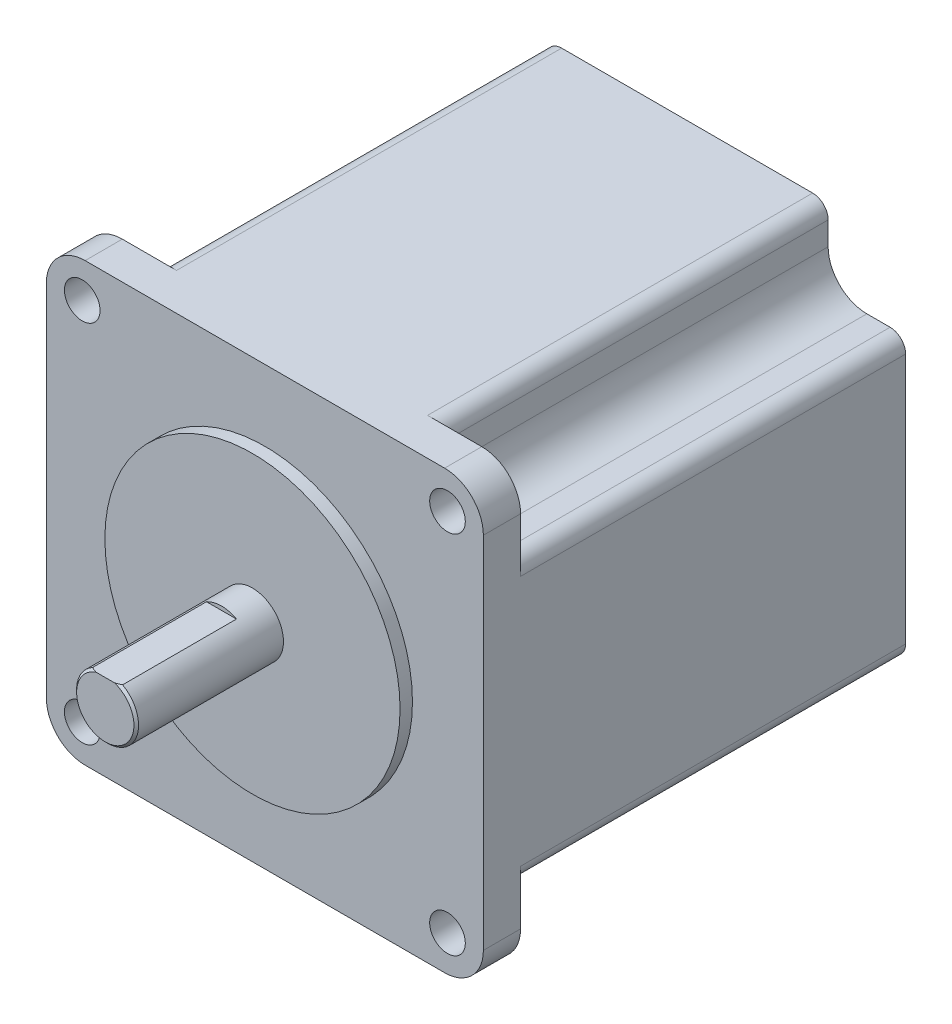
from build123d import *

# Parameters (mm, degrees)
SKETCH_1_R          = 19.05
EXTRUDE_1_DEPTH     = 1.6
SKETCH_2_R          = 4
EXTRUDE_2_DEPTH     = 19
CUT_EXTRUDE_START   = -15
CUT_EXTRUDE_1_DEPTH = 15
EXTRUDE_3_DEPTH     = 54.5
CUT_EXTRUDE_START_2 = -49.7
CUT_EXTRUDE_2_DEPTH = 49.7
SKETCH_6_R          = 2.3
CUT_EXTRUDE_3_DEPTH = 49.7
CHAMFER_1_SIZE      = 0.3


with BuildPart() as part:
    # Sketch 1 → Extrude 1 (new body)
    with BuildSketch(Plane.XY):
        Circle(SKETCH_1_R)
    extrude(amount=-EXTRUDE_1_DEPTH)

    # Sketch 2 → Extrude 2 (add)
    with BuildSketch(Plane.XY):
        Circle(SKETCH_2_R)
    extrude(amount=EXTRUDE_2_DEPTH)

    # Sketch 3 → Cut-Extrude 1 (cut)
    with BuildSketch(Plane.XY.offset(19).offset(CUT_EXTRUDE_START)):
        with BuildLine():
            Line((-1.936491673, 3.5), (1.936491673, 3.5))
            ThreePointArc((1.936491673, 3.5), (0, 4), (-1.936491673, 3.5))
        make_face()
    extrude(amount=CUT_EXTRUDE_1_DEPTH, mode=Mode.SUBTRACT)

    # Sketch 4 → Extrude 3 (add)
    with BuildSketch(Plane(origin=(0, 0, -1.6), x_dir=(-1, 0, 0), z_dir=(0, 0, -1))):
        with BuildLine():
            Line((0, 28.2), (23.2, 28.2))
            ThreePointArc((23.2, 28.2), (26.735533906, 26.735533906), (28.2, 23.2))
            Line((28.2, 23.2), (28.2, -23.2))
            ThreePointArc((28.2, -23.2), (26.735533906, -26.735533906), (23.2, -28.2))
            Line((23.2, -28.2), (-23.2, -28.2))
            ThreePointArc((-23.2, -28.2), (-26.735533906, -26.735533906), (-28.2, -23.2))
            Line((-28.2, -23.2), (-28.2, 23.2))
            ThreePointArc((-28.2, 23.2), (-26.735533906, 26.735533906), (-23.2, 28.2))
            Line((-23.2, 28.2), (0, 28.2))
        make_face()
    extrude(amount=EXTRUDE_3_DEPTH)

    # Sketch 5 → Cut-Extrude 2 (cut)
    with BuildSketch(Plane(origin=(0, 0, -56.1), x_dir=(-1, 0, 0), z_dir=(0, 0, -1)).offset(CUT_EXTRUDE_START_2)):
        with BuildLine():
            Line((11.494440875, 28.2), (16.2, 28.2))
            ThreePointArc((16.2, 28.2), (17.614213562, 27.614213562), (18.2, 26.2))
            Line((18.2, 26.2), (18.2, 23.2))
            ThreePointArc((18.2, 23.2), (19.664466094, 19.664466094), (23.2, 18.2))
            Line((23.2, 18.2), (26.2, 18.2))
            ThreePointArc((26.2, 18.2), (27.614213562, 17.614213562), (28.2, 16.2))
            Line((28.2, 16.2), (28.2, 9.920361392))
            Line((28.2, 9.920361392), (36.460073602, 9.920361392))
            Line((36.460073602, 9.920361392), (36.460073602, 32.177113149))
            Line((36.460073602, 32.177113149), (11.494440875, 32.177113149))
            Line((11.494440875, 32.177113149), (11.494440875, 28.2))
        make_face()
        with BuildLine():
            Line((-11.494440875, 32.177113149), (-11.494440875, 28.2))
            Line((-11.494440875, 28.2), (-16.2, 28.2))
            ThreePointArc((-16.2, 28.2), (-17.614213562, 27.614213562), (-18.2, 26.2))
            Line((-18.2, 26.2), (-18.2, 23.2))
            ThreePointArc((-18.2, 23.2), (-19.664466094, 19.664466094), (-23.2, 18.2))
            Line((-23.2, 18.2), (-26.2, 18.2))
            ThreePointArc((-26.2, 18.2), (-27.614213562, 17.614213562), (-28.2, 16.2))
            Line((-28.2, 16.2), (-28.2, 9.920361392))
            Line((-28.2, 9.920361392), (-36.460073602, 9.920361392))
            Line((-36.460073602, 9.920361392), (-36.460073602, 32.177113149))
            Line((-36.460073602, 32.177113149), (-11.494440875, 32.177113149))
        make_face()
        with BuildLine():
            Line((11.494440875, -32.177113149), (11.494440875, -28.2))
            Line((11.494440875, -28.2), (16.2, -28.2))
            ThreePointArc((16.2, -28.2), (17.614213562, -27.614213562), (18.2, -26.2))
            Line((18.2, -26.2), (18.2, -23.2))
            ThreePointArc((18.2, -23.2), (19.664466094, -19.664466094), (23.2, -18.2))
            Line((23.2, -18.2), (26.2, -18.2))
            ThreePointArc((26.2, -18.2), (27.614213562, -17.614213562), (28.2, -16.2))
            Line((28.2, -16.2), (28.2, -9.920361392))
            Line((28.2, -9.920361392), (36.460073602, -9.920361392))
            Line((36.460073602, -9.920361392), (36.460073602, -32.177113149))
            Line((36.460073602, -32.177113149), (11.494440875, -32.177113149))
        make_face()
        with BuildLine():
            Line((-11.494440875, -28.2), (-16.2, -28.2))
            ThreePointArc((-16.2, -28.2), (-17.614213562, -27.614213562), (-18.2, -26.2))
            Line((-18.2, -26.2), (-18.2, -23.2))
            ThreePointArc((-18.2, -23.2), (-19.664466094, -19.664466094), (-23.2, -18.2))
            Line((-23.2, -18.2), (-26.2, -18.2))
            ThreePointArc((-26.2, -18.2), (-27.614213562, -17.614213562), (-28.2, -16.2))
            Line((-28.2, -16.2), (-28.2, -9.920361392))
            Line((-28.2, -9.920361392), (-36.460073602, -9.920361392))
            Line((-36.460073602, -9.920361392), (-36.460073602, -32.177113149))
            Line((-36.460073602, -32.177113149), (-11.494440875, -32.177113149))
            Line((-11.494440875, -32.177113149), (-11.494440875, -28.2))
        make_face()
    extrude(amount=CUT_EXTRUDE_2_DEPTH, mode=Mode.SUBTRACT)

    # Sketch 6 → Cut-Extrude 3 (cut)
    with BuildSketch(Plane.XY.offset(-1.6)):
        with Locations((-23.57, 23.57)):
            Circle(SKETCH_6_R)
        with Locations((23.57, 23.57)):
            Circle(SKETCH_6_R)
        with Locations((23.57, -23.57)):
            Circle(SKETCH_6_R)
        with Locations((-23.57, -23.57)):
            Circle(SKETCH_6_R)
    extrude(amount=-CUT_EXTRUDE_3_DEPTH, mode=Mode.SUBTRACT)

    # Chamfer 1
    chamfer_1_edges = [part.edges().sort_by_distance(p)[0] for p in [
        (-2.031506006, -3.445719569, 19),
    ]]
    chamfer(chamfer_1_edges, length=CHAMFER_1_SIZE)


solid = part.part
